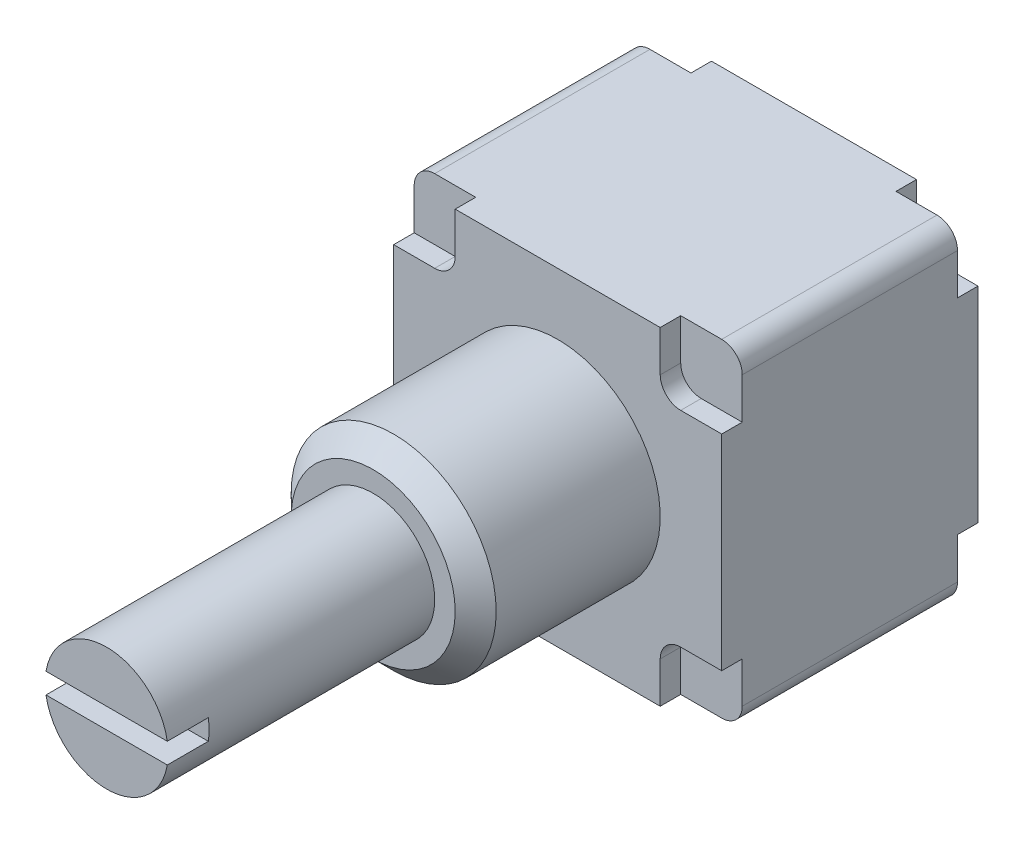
from build123d import *

# Parameters (mm, degrees)
ESQUISSE1_W             = 16
ESQUISSE1_H             = 16
EXTRUSION1_DEPTH        = 12.5
CONG_1_R                = 1
ESQUISSE2_R             = 5
EXTRUSION2_DEPTH        = 9
CHANFREIN1_SIZE         = 1
ESQUISSE3_R             = 3
EXTRUSION3_DEPTH        = 13
ESQUISSE4_W             = 6.995230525
ESQUISSE4_H             = 1
ENL_V_MAT_EXTRU_1_DEPTH = 2
ENL_V_MAT_EXTRU_2_DEPTH = 1
ENL_V_START             = -1
ENL_V_MAT_EXTRU_3_DEPTH = 1


with BuildPart() as part:
    # Esquisse1 → Extrusion1 (new body)
    with BuildSketch(Plane.XY):
        with Locations((8, 8)):
            Rectangle(ESQUISSE1_W, ESQUISSE1_H)
    extrude(amount=EXTRUSION1_DEPTH)

    # Cong_1
    cong_1_edges = [part.edges().sort_by_distance(p)[0] for p in [
        (0, 16, 6.25),
        (16, 16, 6.25),
        (16, 0, 6.25),
        (0, 0, 6.25),
    ]]
    fillet(cong_1_edges, radius=CONG_1_R)

    # Esquisse2 → Extrusion2 (add)
    with BuildSketch(Plane.XY.offset(12.5)):
        with Locations(Location((8, 8, 0), (0, 0, 180))):
            Circle(ESQUISSE2_R)
    extrude(amount=EXTRUSION2_DEPTH)

    # Chanfrein1
    chanfrein1_edges = [part.edges().sort_by_distance(p)[0] for p in [
        (13, 8, 21.5),
    ]]
    chamfer(chanfrein1_edges, length=CHANFREIN1_SIZE)

    # Esquisse3 → Extrusion3 (add)
    with BuildSketch(Plane.XY.offset(21.5)):
        with Locations(Location((8, 8, 0), (0, 0, 180))):
            Circle(ESQUISSE3_R)
    extrude(amount=EXTRUSION3_DEPTH)

    # Esquisse4 → Enl_v. mat.-Extru.1 (cut)
    with BuildSketch(Plane.XY.offset(34.5)):
        with Locations((8.099931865, 8)):
            Rectangle(ESQUISSE4_W, ESQUISSE4_H)
    extrude(amount=-ENL_V_MAT_EXTRU_1_DEPTH, mode=Mode.SUBTRACT)

    # Esquisse5 → Enl_v. mat.-Extru.2 (cut)
    with BuildSketch(Plane.XY.offset(12.5)):
        with BuildLine():
            Line((13, 17.678512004), (13, 14))
            ThreePointArc((13, 14), (13.292893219, 13.292893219), (14, 13))
            Line((14, 13), (16.806932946, 13))
            Line((16.806932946, 13), (16.806932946, 17.678512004))
            Line((16.806932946, 17.678512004), (13, 17.678512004))
        make_face()
        with BuildLine():
            Line((-0.806932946, 17.678512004), (3, 17.678512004))
            Line((3, 17.678512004), (3, 14))
            ThreePointArc((3, 14), (2.707106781, 13.292893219), (2, 13))
            Line((2, 13), (-0.806932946, 13))
            Line((-0.806932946, 13), (-0.806932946, 17.678512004))
        make_face()
        with BuildLine():
            Line((16.806932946, -1.678512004), (13, -1.678512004))
            Line((13, -1.678512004), (13, 2))
            ThreePointArc((13, 2), (13.292893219, 2.707106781), (14, 3))
            Line((14, 3), (16.806932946, 3))
            Line((16.806932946, 3), (16.806932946, -1.678512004))
        make_face()
        with BuildLine():
            Line((3, -1.678512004), (3, 2))
            ThreePointArc((3, 2), (2.707106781, 2.707106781), (2, 3))
            Line((2, 3), (-0.806932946, 3))
            Line((-0.806932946, 3), (-0.806932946, -1.678512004))
            Line((-0.806932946, -1.678512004), (3, -1.678512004))
        make_face()
    extrude(amount=-ENL_V_MAT_EXTRU_2_DEPTH, mode=Mode.SUBTRACT)

    # Esquisse6 → Enl_v. mat.-Extru.3 (cut)
    with BuildSketch(Plane(origin=(0, 0, 0), x_dir=(-1, 0, 0), z_dir=(0, 0, -1)).offset(ENL_V_START)):
        with BuildLine():
            Line((0, 13), (0, 15))
            ThreePointArc((0, 15), (-0.292893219, 15.707106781), (-1, 16))
            Line((-1, 16), (-3, 16))
            Line((-3, 16), (-3, 14))
            ThreePointArc((-3, 14), (-2.707106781, 13.292893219), (-2, 13))
            Line((-2, 13), (0, 13))
        make_face()
        with BuildLine():
            Line((-13, 16), (-15, 16))
            ThreePointArc((-15, 16), (-15.707106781, 15.707106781), (-16, 15))
            Line((-16, 15), (-16, 13))
            Line((-16, 13), (-14, 13))
            ThreePointArc((-14, 13), (-13.292893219, 13.292893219), (-13, 14))
            Line((-13, 14), (-13, 16))
        make_face()
        with BuildLine():
            Line((-3, 0), (-1, 0))
            ThreePointArc((-1, 0), (-0.292893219, 0.292893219), (0, 1))
            Line((0, 1), (0, 3))
            Line((0, 3), (-2, 3))
            ThreePointArc((-2, 3), (-2.707106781, 2.707106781), (-3, 2))
            Line((-3, 2), (-3, 0))
        make_face()
        with BuildLine():
            Line((-15, 0), (-13, 0))
            Line((-13, 0), (-13, 2))
            ThreePointArc((-13, 2), (-13.292893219, 2.707106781), (-14, 3))
            Line((-14, 3), (-16, 3))
            Line((-16, 3), (-16, 1))
            ThreePointArc((-16, 1), (-15.707106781, 0.292893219), (-15, 0))
        make_face()
    extrude(amount=ENL_V_MAT_EXTRU_3_DEPTH, mode=Mode.SUBTRACT)


solid = part.part
